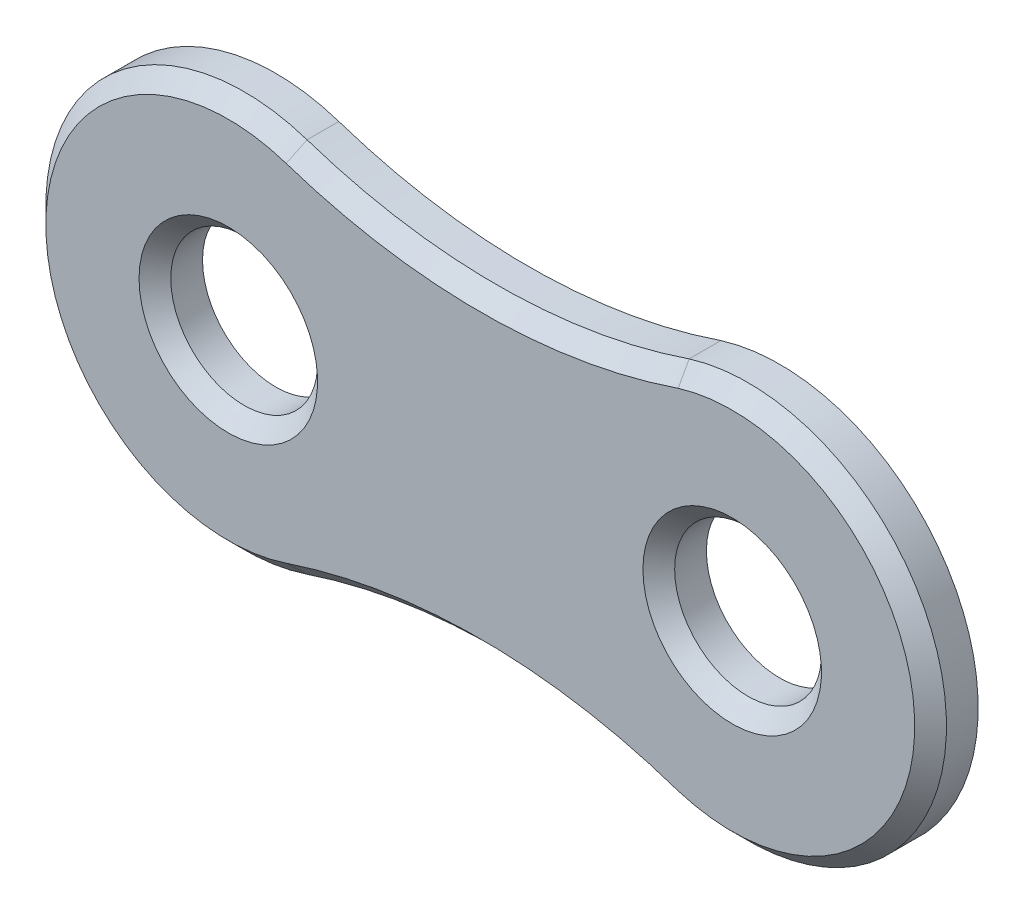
from build123d import *

# Parameters (mm, degrees)
ESQUISSE1_R          = 0.925
BASE_EXTRUSION_DEPTH = 0.6
CHANFREIN1_SIZE      = 0.2


with BuildPart() as part:
    # Esquisse1 → Base-Extrusion (new body)
    with BuildSketch(Plane.XY):
        with BuildLine():
            ThreePointArc((-2.382416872, 2.371036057), (-5.675, 0), (-2.382416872, -2.371036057))
            ThreePointArc((-2.382416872, -2.371036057), (0.026250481, -1.983242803), (2.432272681, -2.387122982))
            ThreePointArc((2.432272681, -2.387122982), (5.675, 0), (2.432272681, 2.387122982))
            ThreePointArc((2.432272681, 2.387122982), (0.026250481, 1.983242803), (-2.382416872, 2.371036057))
        make_face()
        with Locations(Location((-3.175, 0, 0), (0, 0, 180))):
            Circle(ESQUISSE1_R, mode=Mode.SUBTRACT)
        with Locations(Location((3.175, 0, 0), (0, 0, 180))):
            Circle(ESQUISSE1_R, mode=Mode.SUBTRACT)
    extrude(amount=BASE_EXTRUSION_DEPTH)

    # Chanfrein1
    chanfrein1_edges = [part.edges().sort_by_distance(p)[0] for p in [
        (-5.675, 0, 0.6),
        (0.026250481, -1.983242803, 0.6),
        (5.675, 0, 0.6),
        (0.026250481, 1.983242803, 0.6),
        (-2.25, 0, 0.6),
        (4.1, 0, 0.6),
    ]]
    chamfer(chanfrein1_edges, length=CHANFREIN1_SIZE)


solid = part.part
